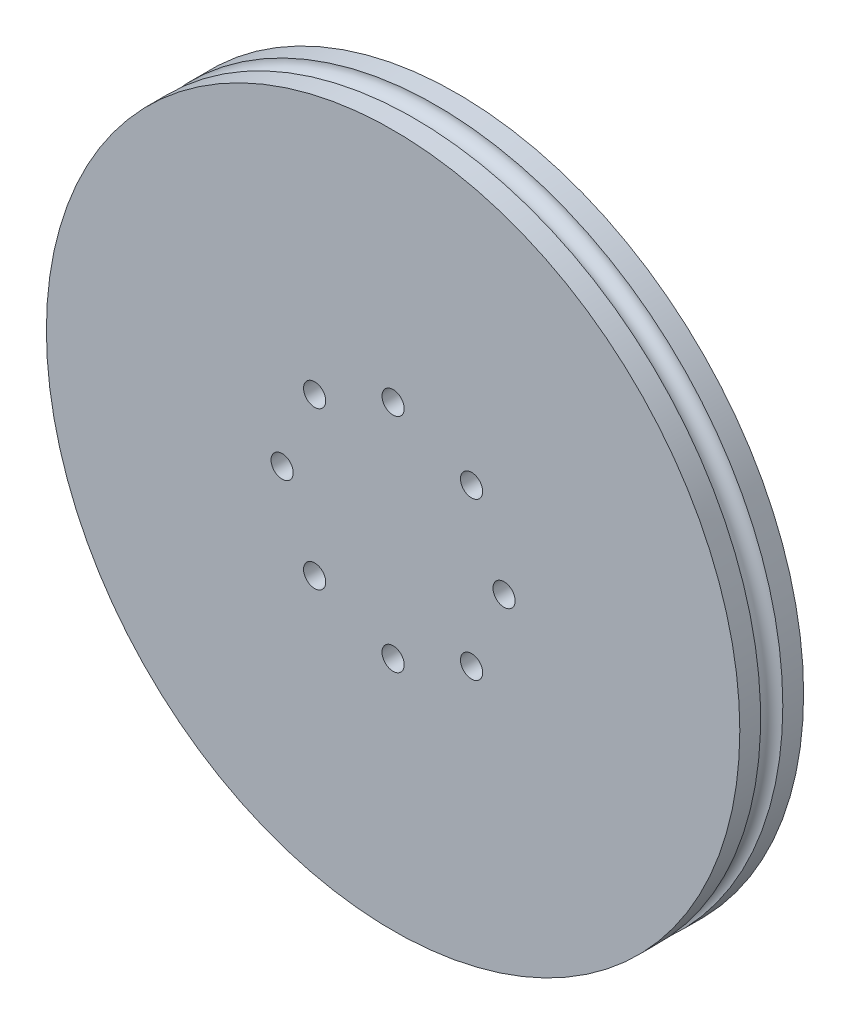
ISO-10303-21;
HEADER;
FILE_DESCRIPTION(('STEP AP214'),'2;1');
FILE_NAME('part.step','',(''),(''),'','','');
FILE_SCHEMA(('AUTOMOTIVE_DESIGN { 1 0 10303 214 1 1 1 1 }'));
ENDSEC;
DATA;
#1=APPLICATION_CONTEXT('core data for automotive mechanical design processes');
#2=APPLICATION_PROTOCOL_DEFINITION('international standard','automotive_design',2000,#1);
#3=PRODUCT_CONTEXT('',#1,'mechanical');
#4=PRODUCT('Part','Part','',(#3));
#5=PRODUCT_RELATED_PRODUCT_CATEGORY('part','',(#4));
#6=PRODUCT_DEFINITION_FORMATION('','',#4);
#7=PRODUCT_DEFINITION_CONTEXT('part definition',#1,'design');
#8=PRODUCT_DEFINITION('design','',#6,#7);
#9=PRODUCT_DEFINITION_SHAPE('','',#8);
#10=(LENGTH_UNIT() NAMED_UNIT(*) SI_UNIT(.MILLI.,.METRE.));
#11=(NAMED_UNIT(*) PLANE_ANGLE_UNIT() SI_UNIT($,.RADIAN.));
#12=(NAMED_UNIT(*) SI_UNIT($,.STERADIAN.) SOLID_ANGLE_UNIT());
#13=UNCERTAINTY_MEASURE_WITH_UNIT(LENGTH_MEASURE(1.E-05),#10,'distance_accuracy_value','');
#14=(GEOMETRIC_REPRESENTATION_CONTEXT(3) GLOBAL_UNCERTAINTY_ASSIGNED_CONTEXT((#13)) GLOBAL_UNIT_ASSIGNED_CONTEXT((#10,
#11,#12)) REPRESENTATION_CONTEXT('',''));
#15=CARTESIAN_POINT('',(0.,0.,0.));
#16=DIRECTION('',(0.,0.,1.));
#17=DIRECTION('',(1.,0.,0.));
#18=AXIS2_PLACEMENT_3D('',#15,#16,#17);
#19=CARTESIAN_POINT('',(0.,0.,23.));
#20=DIRECTION('',(0.,0.,-1.));
#21=DIRECTION('',(-1.,0.,0.));
#22=AXIS2_PLACEMENT_3D('',#19,#20,#21);
#23=CYLINDRICAL_SURFACE('',#22,125.);
#24=CARTESIAN_POINT('',(0.,0.,0.));
#25=DIRECTION('',(0.,0.,1.));
#26=DIRECTION('',(1.,0.,0.));
#27=AXIS2_PLACEMENT_3D('',#24,#25,#26);
#28=CIRCLE('',#27,125.);
#29=CARTESIAN_POINT('',(125.,0.,0.));
#30=VERTEX_POINT('',#29);
#31=EDGE_CURVE('E37',#30,#30,#28,.T.);
#32=ORIENTED_EDGE('',*,*,#31,.T.);
#33=EDGE_LOOP('',(#32));
#34=FACE_BOUND('',#33,.T.);
#35=CARTESIAN_POINT('',(0.,0.,7.50000000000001));
#36=DIRECTION('',(0.,0.,1.));
#37=DIRECTION('',(1.,0.,0.));
#38=AXIS2_PLACEMENT_3D('',#35,#36,#37);
#39=CIRCLE('',#38,125.);
#40=CARTESIAN_POINT('',(125.,0.,7.50000000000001));
#41=VERTEX_POINT('',#40);
#42=EDGE_CURVE('E33',#41,#41,#39,.T.);
#43=ORIENTED_EDGE('',*,*,#42,.F.);
#44=EDGE_LOOP('',(#43));
#45=FACE_BOUND('',#44,.T.);
#46=ADVANCED_FACE('F30',(#34,#45),#23,.T.);
#47=CARTESIAN_POINT('',(0.,0.,23.));
#48=DIRECTION('',(0.,0.,1.));
#49=DIRECTION('',(1.,0.,0.));
#50=AXIS2_PLACEMENT_3D('',#47,#48,#49);
#51=CIRCLE('',#50,125.);
#52=CARTESIAN_POINT('',(125.,0.,23.));
#53=VERTEX_POINT('',#52);
#54=EDGE_CURVE('E10',#53,#53,#51,.T.);
#55=ORIENTED_EDGE('',*,*,#54,.F.);
#56=EDGE_LOOP('',(#55));
#57=FACE_BOUND('',#56,.T.);
#58=CARTESIAN_POINT('',(0.,0.,15.5));
#59=DIRECTION('',(0.,0.,-1.));
#60=DIRECTION('',(-1.,0.,0.));
#61=AXIS2_PLACEMENT_3D('',#58,#59,#60);
#62=CIRCLE('',#61,125.);
#63=CARTESIAN_POINT('',(-125.,0.,15.5));
#64=VERTEX_POINT('',#63);
#65=EDGE_CURVE('E47',#64,#64,#62,.T.);
#66=ORIENTED_EDGE('',*,*,#65,.F.);
#67=EDGE_LOOP('',(#66));
#68=FACE_BOUND('',#67,.T.);
#69=ADVANCED_FACE('F122',(#57,#68),#23,.T.);
#70=CARTESIAN_POINT('',(0.,0.,23.));
#71=DIRECTION('',(0.,0.,1.));
#72=DIRECTION('',(1.,0.,0.));
#73=AXIS2_PLACEMENT_3D('',#70,#71,#72);
#74=PLANE('',#73);
#75=CARTESIAN_POINT('',(-39.999,-0.00100000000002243,23.));
#76=DIRECTION('',(0.,0.,1.));
#77=DIRECTION('',(1.,0.,0.));
#78=AXIS2_PLACEMENT_3D('',#75,#76,#77);
#79=CIRCLE('',#78,4.00000000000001);
#80=CARTESIAN_POINT('',(-35.999,-0.00100000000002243,23.));
#81=VERTEX_POINT('',#80);
#82=EDGE_CURVE('E64',#81,#81,#79,.T.);
#83=ORIENTED_EDGE('',*,*,#82,.F.);
#84=EDGE_LOOP('',(#83));
#85=FACE_BOUND('',#84,.T.);
#86=CARTESIAN_POINT('',(0.00200000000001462,-40.,23.));
#87=DIRECTION('',(0.,0.,1.));
#88=DIRECTION('',(1.,0.,0.));
#89=AXIS2_PLACEMENT_3D('',#86,#87,#88);
#90=CIRCLE('',#89,4.);
#91=CARTESIAN_POINT('',(4.00200000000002,-40.,23.));
#92=VERTEX_POINT('',#91);
#93=EDGE_CURVE('E76',#92,#92,#90,.T.);
#94=ORIENTED_EDGE('',*,*,#93,.F.);
#95=EDGE_LOOP('',(#94));
#96=FACE_BOUND('',#95,.T.);
#97=CARTESIAN_POINT('',(40.001,0.00100000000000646,23.));
#98=DIRECTION('',(0.,0.,1.));
#99=DIRECTION('',(1.,0.,0.));
#100=AXIS2_PLACEMENT_3D('',#97,#98,#99);
#101=CIRCLE('',#100,4.00000000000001);
#102=CARTESIAN_POINT('',(44.001,0.00100000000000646,23.));
#103=VERTEX_POINT('',#102);
#104=EDGE_CURVE('E88',#103,#103,#101,.T.);
#105=ORIENTED_EDGE('',*,*,#104,.F.);
#106=EDGE_LOOP('',(#105));
#107=FACE_BOUND('',#106,.T.);
#108=CARTESIAN_POINT('',(0.,40.,23.));
#109=DIRECTION('',(0.,0.,1.));
#110=DIRECTION('',(1.,0.,0.));
#111=AXIS2_PLACEMENT_3D('',#108,#109,#110);
#112=CIRCLE('',#111,4.);
#113=CARTESIAN_POINT('',(4.,40.,23.));
#114=VERTEX_POINT('',#113);
#115=EDGE_CURVE('E42',#114,#114,#112,.T.);
#116=ORIENTED_EDGE('',*,*,#115,.F.);
#117=EDGE_LOOP('',(#116));
#118=FACE_BOUND('',#117,.T.);
#119=ORIENTED_EDGE('',*,*,#54,.T.);
#120=EDGE_LOOP('',(#119));
#121=FACE_BOUND('',#120,.T.);
#122=CARTESIAN_POINT('',(28.2845641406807,28.2849783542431,23.));
#123=DIRECTION('',(0.,0.,1.));
#124=DIRECTION('',(1.,0.,0.));
#125=AXIS2_PLACEMENT_3D('',#122,#123,#124);
#126=CIRCLE('',#125,4.);
#127=CARTESIAN_POINT('',(32.2845641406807,28.2849783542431,23.));
#128=VERTEX_POINT('',#127);
#129=EDGE_CURVE('E94',#128,#128,#126,.T.);
#130=ORIENTED_EDGE('',*,*,#129,.F.);
#131=EDGE_LOOP('',(#130));
#132=FACE_BOUND('',#131,.T.);
#133=CARTESIAN_POINT('',(28.2859783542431,-28.2835641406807,23.));
#134=DIRECTION('',(0.,0.,1.));
#135=DIRECTION('',(1.,0.,0.));
#136=AXIS2_PLACEMENT_3D('',#133,#134,#135);
#137=CIRCLE('',#136,4.);
#138=CARTESIAN_POINT('',(32.2859783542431,-28.2835641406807,23.));
#139=VERTEX_POINT('',#138);
#140=EDGE_CURVE('E82',#139,#139,#137,.T.);
#141=ORIENTED_EDGE('',*,*,#140,.F.);
#142=EDGE_LOOP('',(#141));
#143=FACE_BOUND('',#142,.T.);
#144=CARTESIAN_POINT('',(-28.2825641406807,-28.2849783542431,23.));
#145=DIRECTION('',(0.,0.,1.));
#146=DIRECTION('',(1.,0.,0.));
#147=AXIS2_PLACEMENT_3D('',#144,#145,#146);
#148=CIRCLE('',#147,4.);
#149=CARTESIAN_POINT('',(-24.2825641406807,-28.2849783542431,23.));
#150=VERTEX_POINT('',#149);
#151=EDGE_CURVE('E70',#150,#150,#148,.T.);
#152=ORIENTED_EDGE('',*,*,#151,.F.);
#153=EDGE_LOOP('',(#152));
#154=FACE_BOUND('',#153,.T.);
#155=CARTESIAN_POINT('',(-28.2839783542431,28.2835641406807,23.));
#156=DIRECTION('',(0.,0.,1.));
#157=DIRECTION('',(1.,0.,0.));
#158=AXIS2_PLACEMENT_3D('',#155,#156,#157);
#159=CIRCLE('',#158,4.);
#160=CARTESIAN_POINT('',(-24.2839783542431,28.2835641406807,23.));
#161=VERTEX_POINT('',#160);
#162=EDGE_CURVE('E56',#161,#161,#159,.T.);
#163=ORIENTED_EDGE('',*,*,#162,.F.);
#164=EDGE_LOOP('',(#163));
#165=FACE_BOUND('',#164,.T.);
#166=ADVANCED_FACE('F118',(#85,#96,#107,#118,#121,#132,#143,#154,#165),#74,.T.);
#167=CARTESIAN_POINT('',(0.,0.,0.));
#168=DIRECTION('',(0.,0.,1.));
#169=DIRECTION('',(1.,0.,0.));
#170=AXIS2_PLACEMENT_3D('',#167,#168,#169);
#171=PLANE('',#170);
#172=CARTESIAN_POINT('',(-39.999,-0.00100000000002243,0.));
#173=DIRECTION('',(0.,0.,1.));
#174=DIRECTION('',(1.,0.,0.));
#175=AXIS2_PLACEMENT_3D('',#172,#173,#174);
#176=CIRCLE('',#175,4.00000000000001);
#177=CARTESIAN_POINT('',(-35.999,-0.00100000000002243,0.));
#178=VERTEX_POINT('',#177);
#179=EDGE_CURVE('E61',#178,#178,#176,.T.);
#180=ORIENTED_EDGE('',*,*,#179,.T.);
#181=EDGE_LOOP('',(#180));
#182=FACE_BOUND('',#181,.T.);
#183=CARTESIAN_POINT('',(0.00200000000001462,-40.,0.));
#184=DIRECTION('',(0.,0.,1.));
#185=DIRECTION('',(1.,0.,0.));
#186=AXIS2_PLACEMENT_3D('',#183,#184,#185);
#187=CIRCLE('',#186,4.);
#188=CARTESIAN_POINT('',(4.00200000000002,-40.,0.));
#189=VERTEX_POINT('',#188);
#190=EDGE_CURVE('E73',#189,#189,#187,.T.);
#191=ORIENTED_EDGE('',*,*,#190,.T.);
#192=EDGE_LOOP('',(#191));
#193=FACE_BOUND('',#192,.T.);
#194=CARTESIAN_POINT('',(40.001,0.00100000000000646,0.));
#195=DIRECTION('',(0.,0.,1.));
#196=DIRECTION('',(1.,0.,0.));
#197=AXIS2_PLACEMENT_3D('',#194,#195,#196);
#198=CIRCLE('',#197,4.00000000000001);
#199=CARTESIAN_POINT('',(44.001,0.00100000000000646,0.));
#200=VERTEX_POINT('',#199);
#201=EDGE_CURVE('E85',#200,#200,#198,.T.);
#202=ORIENTED_EDGE('',*,*,#201,.T.);
#203=EDGE_LOOP('',(#202));
#204=FACE_BOUND('',#203,.T.);
#205=CARTESIAN_POINT('',(0.,40.,0.));
#206=DIRECTION('',(0.,0.,1.));
#207=DIRECTION('',(1.,0.,0.));
#208=AXIS2_PLACEMENT_3D('',#205,#206,#207);
#209=CIRCLE('',#208,4.);
#210=CARTESIAN_POINT('',(4.,40.,0.));
#211=VERTEX_POINT('',#210);
#212=EDGE_CURVE('E45',#211,#211,#209,.T.);
#213=ORIENTED_EDGE('',*,*,#212,.T.);
#214=EDGE_LOOP('',(#213));
#215=FACE_BOUND('',#214,.T.);
#216=ORIENTED_EDGE('',*,*,#31,.F.);
#217=EDGE_LOOP('',(#216));
#218=FACE_BOUND('',#217,.T.);
#219=CARTESIAN_POINT('',(28.2845641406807,28.2849783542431,0.));
#220=DIRECTION('',(0.,0.,1.));
#221=DIRECTION('',(1.,0.,0.));
#222=AXIS2_PLACEMENT_3D('',#219,#220,#221);
#223=CIRCLE('',#222,4.);
#224=CARTESIAN_POINT('',(32.2845641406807,28.2849783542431,0.));
#225=VERTEX_POINT('',#224);
#226=EDGE_CURVE('E91',#225,#225,#223,.T.);
#227=ORIENTED_EDGE('',*,*,#226,.T.);
#228=EDGE_LOOP('',(#227));
#229=FACE_BOUND('',#228,.T.);
#230=CARTESIAN_POINT('',(28.2859783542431,-28.2835641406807,0.));
#231=DIRECTION('',(0.,0.,1.));
#232=DIRECTION('',(1.,0.,0.));
#233=AXIS2_PLACEMENT_3D('',#230,#231,#232);
#234=CIRCLE('',#233,4.);
#235=CARTESIAN_POINT('',(32.2859783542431,-28.2835641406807,0.));
#236=VERTEX_POINT('',#235);
#237=EDGE_CURVE('E79',#236,#236,#234,.T.);
#238=ORIENTED_EDGE('',*,*,#237,.T.);
#239=EDGE_LOOP('',(#238));
#240=FACE_BOUND('',#239,.T.);
#241=CARTESIAN_POINT('',(-28.2825641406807,-28.2849783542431,0.));
#242=DIRECTION('',(0.,0.,1.));
#243=DIRECTION('',(1.,0.,0.));
#244=AXIS2_PLACEMENT_3D('',#241,#242,#243);
#245=CIRCLE('',#244,4.);
#246=CARTESIAN_POINT('',(-24.2825641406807,-28.2849783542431,0.));
#247=VERTEX_POINT('',#246);
#248=EDGE_CURVE('E67',#247,#247,#245,.T.);
#249=ORIENTED_EDGE('',*,*,#248,.T.);
#250=EDGE_LOOP('',(#249));
#251=FACE_BOUND('',#250,.T.);
#252=CARTESIAN_POINT('',(-28.2839783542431,28.2835641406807,0.));
#253=DIRECTION('',(0.,0.,1.));
#254=DIRECTION('',(1.,0.,0.));
#255=AXIS2_PLACEMENT_3D('',#252,#253,#254);
#256=CIRCLE('',#255,4.);
#257=CARTESIAN_POINT('',(-24.2839783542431,28.2835641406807,0.));
#258=VERTEX_POINT('',#257);
#259=EDGE_CURVE('E52',#258,#258,#256,.T.);
#260=ORIENTED_EDGE('',*,*,#259,.T.);
#261=EDGE_LOOP('',(#260));
#262=FACE_BOUND('',#261,.T.);
#263=ADVANCED_FACE('F104',(#182,#193,#204,#215,#218,#229,#240,#251,#262),#171,.F.);
#264=CARTESIAN_POINT('',(0.,40.,23.));
#265=DIRECTION('',(0.,0.,-1.));
#266=DIRECTION('',(-1.,0.,0.));
#267=AXIS2_PLACEMENT_3D('',#264,#265,#266);
#268=CYLINDRICAL_SURFACE('',#267,4.);
#269=ORIENTED_EDGE('',*,*,#115,.T.);
#270=EDGE_LOOP('',(#269));
#271=FACE_BOUND('',#270,.T.);
#272=ORIENTED_EDGE('',*,*,#212,.F.);
#273=EDGE_LOOP('',(#272));
#274=FACE_BOUND('',#273,.T.);
#275=ADVANCED_FACE('F107',(#271,#274),#268,.F.);
#276=CARTESIAN_POINT('',(28.2845641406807,28.2849783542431,23.));
#277=DIRECTION('',(0.,0.,-1.));
#278=DIRECTION('',(-1.,0.,0.));
#279=AXIS2_PLACEMENT_3D('',#276,#277,#278);
#280=CYLINDRICAL_SURFACE('',#279,4.);
#281=ORIENTED_EDGE('',*,*,#129,.T.);
#282=EDGE_LOOP('',(#281));
#283=FACE_BOUND('',#282,.T.);
#284=ORIENTED_EDGE('',*,*,#226,.F.);
#285=EDGE_LOOP('',(#284));
#286=FACE_BOUND('',#285,.T.);
#287=ADVANCED_FACE('F109',(#283,#286),#280,.F.);
#288=CARTESIAN_POINT('',(40.001,0.00100000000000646,23.));
#289=DIRECTION('',(0.,0.,-1.));
#290=DIRECTION('',(-1.,0.,0.));
#291=AXIS2_PLACEMENT_3D('',#288,#289,#290);
#292=CYLINDRICAL_SURFACE('',#291,4.00000000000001);
#293=ORIENTED_EDGE('',*,*,#104,.T.);
#294=EDGE_LOOP('',(#293));
#295=FACE_BOUND('',#294,.T.);
#296=ORIENTED_EDGE('',*,*,#201,.F.);
#297=EDGE_LOOP('',(#296));
#298=FACE_BOUND('',#297,.T.);
#299=ADVANCED_FACE('F115',(#295,#298),#292,.F.);
#300=CARTESIAN_POINT('',(28.2859783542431,-28.2835641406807,23.));
#301=DIRECTION('',(0.,0.,-1.));
#302=DIRECTION('',(-1.,0.,0.));
#303=AXIS2_PLACEMENT_3D('',#300,#301,#302);
#304=CYLINDRICAL_SURFACE('',#303,4.);
#305=ORIENTED_EDGE('',*,*,#140,.T.);
#306=EDGE_LOOP('',(#305));
#307=FACE_BOUND('',#306,.T.);
#308=ORIENTED_EDGE('',*,*,#237,.F.);
#309=EDGE_LOOP('',(#308));
#310=FACE_BOUND('',#309,.T.);
#311=ADVANCED_FACE('F150',(#307,#310),#304,.F.);
#312=CARTESIAN_POINT('',(0.00200000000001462,-40.,23.));
#313=DIRECTION('',(0.,0.,-1.));
#314=DIRECTION('',(-1.,0.,0.));
#315=AXIS2_PLACEMENT_3D('',#312,#313,#314);
#316=CYLINDRICAL_SURFACE('',#315,4.);
#317=ORIENTED_EDGE('',*,*,#93,.T.);
#318=EDGE_LOOP('',(#317));
#319=FACE_BOUND('',#318,.T.);
#320=ORIENTED_EDGE('',*,*,#190,.F.);
#321=EDGE_LOOP('',(#320));
#322=FACE_BOUND('',#321,.T.);
#323=ADVANCED_FACE('F140',(#319,#322),#316,.F.);
#324=CARTESIAN_POINT('',(-28.2825641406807,-28.2849783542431,23.));
#325=DIRECTION('',(0.,0.,-1.));
#326=DIRECTION('',(-1.,0.,0.));
#327=AXIS2_PLACEMENT_3D('',#324,#325,#326);
#328=CYLINDRICAL_SURFACE('',#327,4.);
#329=ORIENTED_EDGE('',*,*,#151,.T.);
#330=EDGE_LOOP('',(#329));
#331=FACE_BOUND('',#330,.T.);
#332=ORIENTED_EDGE('',*,*,#248,.F.);
#333=EDGE_LOOP('',(#332));
#334=FACE_BOUND('',#333,.T.);
#335=ADVANCED_FACE('F137',(#331,#334),#328,.F.);
#336=CARTESIAN_POINT('',(-39.999,-0.00100000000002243,23.));
#337=DIRECTION('',(0.,0.,-1.));
#338=DIRECTION('',(-1.,0.,0.));
#339=AXIS2_PLACEMENT_3D('',#336,#337,#338);
#340=CYLINDRICAL_SURFACE('',#339,4.00000000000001);
#341=ORIENTED_EDGE('',*,*,#82,.T.);
#342=EDGE_LOOP('',(#341));
#343=FACE_BOUND('',#342,.T.);
#344=ORIENTED_EDGE('',*,*,#179,.F.);
#345=EDGE_LOOP('',(#344));
#346=FACE_BOUND('',#345,.T.);
#347=ADVANCED_FACE('F139',(#343,#346),#340,.F.);
#348=CARTESIAN_POINT('',(-28.2839783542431,28.2835641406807,23.));
#349=DIRECTION('',(0.,0.,-1.));
#350=DIRECTION('',(-1.,0.,0.));
#351=AXIS2_PLACEMENT_3D('',#348,#349,#350);
#352=CYLINDRICAL_SURFACE('',#351,4.);
#353=ORIENTED_EDGE('',*,*,#162,.T.);
#354=EDGE_LOOP('',(#353));
#355=FACE_BOUND('',#354,.T.);
#356=ORIENTED_EDGE('',*,*,#259,.F.);
#357=EDGE_LOOP('',(#356));
#358=FACE_BOUND('',#357,.T.);
#359=ADVANCED_FACE('F147',(#355,#358),#352,.F.);
#360=CARTESIAN_POINT('',(0.,0.,11.5));
#361=DIRECTION('',(0.,0.,-1.));
#362=DIRECTION('',(-1.,0.,0.));
#363=AXIS2_PLACEMENT_3D('',#360,#361,#362);
#364=TOROIDAL_SURFACE('',#363,125.,3.99999999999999);
#365=ORIENTED_EDGE('',*,*,#65,.T.);
#366=EDGE_LOOP('',(#365));
#367=FACE_BOUND('',#366,.T.);
#368=ORIENTED_EDGE('',*,*,#42,.T.);
#369=EDGE_LOOP('',(#368));
#370=FACE_BOUND('',#369,.T.);
#371=ADVANCED_FACE('F181',(#367,#370),#364,.F.);
#372=CLOSED_SHELL('',(#46,#69,#166,#263,#275,#287,#299,#311,#323,#335,#347,#359,#371));
#373=MANIFOLD_SOLID_BREP('B2',#372);
#374=ADVANCED_BREP_SHAPE_REPRESENTATION('',(#18,#373),#14);
#375=SHAPE_DEFINITION_REPRESENTATION(#9,#374);
ENDSEC;
END-ISO-10303-21;
